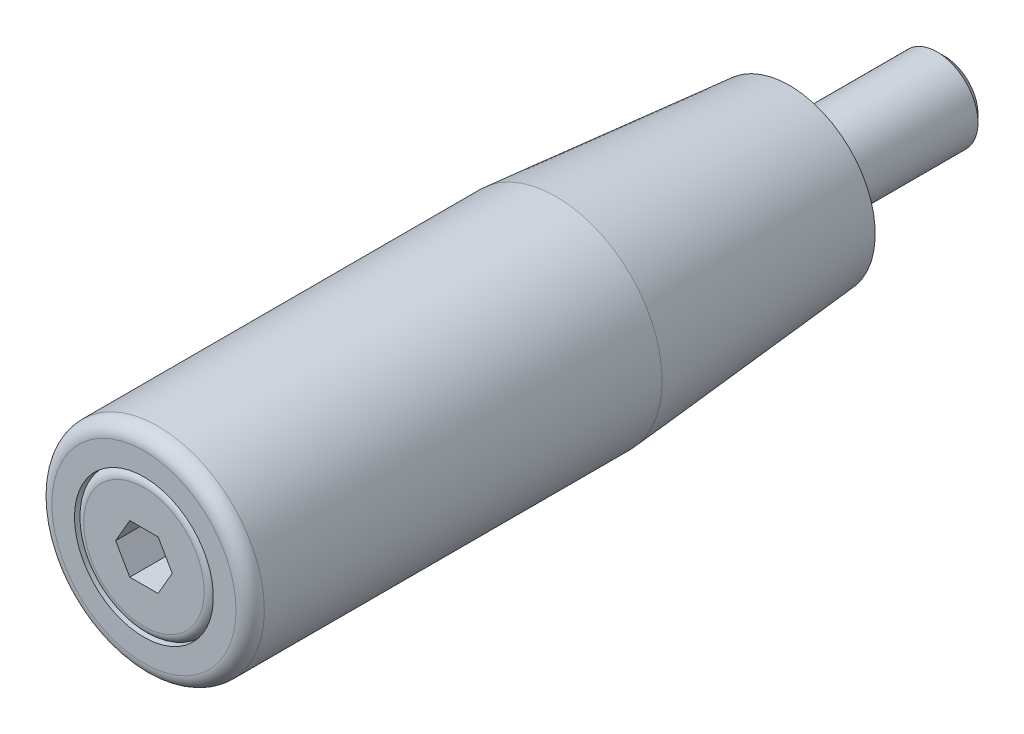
ISO-10303-21;
HEADER;
FILE_DESCRIPTION(('STEP AP214'),'2;1');
FILE_NAME('part.step','',(''),(''),'','','');
FILE_SCHEMA(('AUTOMOTIVE_DESIGN { 1 0 10303 214 1 1 1 1 }'));
ENDSEC;
DATA;
#1=APPLICATION_CONTEXT('core data for automotive mechanical design processes');
#2=APPLICATION_PROTOCOL_DEFINITION('international standard','automotive_design',2000,#1);
#3=PRODUCT_CONTEXT('',#1,'mechanical');
#4=PRODUCT('Part','Part','',(#3));
#5=PRODUCT_RELATED_PRODUCT_CATEGORY('part','',(#4));
#6=PRODUCT_DEFINITION_FORMATION('','',#4);
#7=PRODUCT_DEFINITION_CONTEXT('part definition',#1,'design');
#8=PRODUCT_DEFINITION('design','',#6,#7);
#9=PRODUCT_DEFINITION_SHAPE('','',#8);
#10=(LENGTH_UNIT() NAMED_UNIT(*) SI_UNIT(.MILLI.,.METRE.));
#11=(NAMED_UNIT(*) PLANE_ANGLE_UNIT() SI_UNIT($,.RADIAN.));
#12=(NAMED_UNIT(*) SI_UNIT($,.STERADIAN.) SOLID_ANGLE_UNIT());
#13=UNCERTAINTY_MEASURE_WITH_UNIT(LENGTH_MEASURE(1.E-05),#10,'distance_accuracy_value','');
#14=(GEOMETRIC_REPRESENTATION_CONTEXT(3) GLOBAL_UNCERTAINTY_ASSIGNED_CONTEXT((#13)) GLOBAL_UNIT_ASSIGNED_CONTEXT((#10,
#11,#12)) REPRESENTATION_CONTEXT('',''));
#15=CARTESIAN_POINT('',(0.,0.,0.));
#16=DIRECTION('',(0.,0.,1.));
#17=DIRECTION('',(1.,0.,0.));
#18=AXIS2_PLACEMENT_3D('',#15,#16,#17);
#19=CARTESIAN_POINT('',(0.,-4.,0.));
#20=DIRECTION('',(0.,0.,1.));
#21=DIRECTION('',(-1.,0.,0.));
#22=AXIS2_PLACEMENT_3D('',#19,#20,#21);
#23=PLANE('',#22);
#24=CARTESIAN_POINT('',(0.,0.,0.));
#25=DIRECTION('',(0.,0.,1.));
#26=DIRECTION('',(-1.,0.,0.));
#27=AXIS2_PLACEMENT_3D('',#24,#25,#26);
#28=CIRCLE('',#27,6.5);
#29=CARTESIAN_POINT('',(-6.5,0.,0.));
#30=VERTEX_POINT('',#29);
#31=EDGE_CURVE('E121',#30,#30,#28,.T.);
#32=ORIENTED_EDGE('',*,*,#31,.F.);
#33=EDGE_LOOP('',(#32));
#34=FACE_BOUND('',#33,.T.);
#35=CARTESIAN_POINT('',(0.,0.,0.));
#36=DIRECTION('',(0.,0.,1.));
#37=DIRECTION('',(-1.,0.,0.));
#38=AXIS2_PLACEMENT_3D('',#35,#36,#37);
#39=CIRCLE('',#38,4.);
#40=CARTESIAN_POINT('',(-4.,0.,0.));
#41=VERTEX_POINT('',#40);
#42=EDGE_CURVE('E124',#41,#41,#39,.T.);
#43=ORIENTED_EDGE('',*,*,#42,.T.);
#44=EDGE_LOOP('',(#43));
#45=FACE_BOUND('',#44,.T.);
#46=ADVANCED_FACE('F15',(#34,#45),#23,.F.);
#47=CARTESIAN_POINT('',(0.,-5.58637014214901E-13,80.));
#48=DIRECTION('',(0.,0.,1.));
#49=DIRECTION('',(-1.,0.,0.));
#50=AXIS2_PLACEMENT_3D('',#47,#48,#49);
#51=CYLINDRICAL_SURFACE('',#50,4.);
#52=ORIENTED_EDGE('',*,*,#42,.F.);
#53=EDGE_LOOP('',(#52));
#54=FACE_BOUND('',#53,.T.);
#55=CARTESIAN_POINT('',(0.,0.,-1.5));
#56=DIRECTION('',(0.,0.,1.));
#57=DIRECTION('',(-1.,0.,0.));
#58=AXIS2_PLACEMENT_3D('',#55,#56,#57);
#59=CIRCLE('',#58,4.);
#60=CARTESIAN_POINT('',(-4.,0.,-1.5));
#61=VERTEX_POINT('',#60);
#62=EDGE_CURVE('E127',#61,#61,#59,.T.);
#63=ORIENTED_EDGE('',*,*,#62,.T.);
#64=EDGE_LOOP('',(#63));
#65=FACE_BOUND('',#64,.T.);
#66=ADVANCED_FACE('F246',(#54,#65),#51,.T.);
#67=CARTESIAN_POINT('',(0.,-4.08,-1.50000000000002));
#68=DIRECTION('',(0.,0.,-1.));
#69=DIRECTION('',(1.,0.,0.));
#70=AXIS2_PLACEMENT_3D('',#67,#68,#69);
#71=PLANE('',#70);
#72=ORIENTED_EDGE('',*,*,#62,.F.);
#73=EDGE_LOOP('',(#72));
#74=FACE_BOUND('',#73,.T.);
#75=CARTESIAN_POINT('',(0.,0.,-1.5));
#76=DIRECTION('',(0.,0.,1.));
#77=DIRECTION('',(-1.,0.,0.));
#78=AXIS2_PLACEMENT_3D('',#75,#76,#77);
#79=CIRCLE('',#78,4.08);
#80=CARTESIAN_POINT('',(-4.08,0.,-1.5));
#81=VERTEX_POINT('',#80);
#82=EDGE_CURVE('E130',#81,#81,#79,.T.);
#83=ORIENTED_EDGE('',*,*,#82,.T.);
#84=EDGE_LOOP('',(#83));
#85=FACE_BOUND('',#84,.T.);
#86=ADVANCED_FACE('F242',(#74,#85),#71,.F.);
#87=CARTESIAN_POINT('',(0.,0.,-2.42));
#88=DIRECTION('',(0.,0.,-1.));
#89=DIRECTION('',(1.,0.,0.));
#90=AXIS2_PLACEMENT_3D('',#87,#88,#89);
#91=CONICAL_SURFACE('',#90,5.,0.785398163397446);
#92=ORIENTED_EDGE('',*,*,#82,.F.);
#93=EDGE_LOOP('',(#92));
#94=FACE_BOUND('',#93,.T.);
#95=CARTESIAN_POINT('',(0.,0.,-2.42));
#96=DIRECTION('',(0.,0.,1.));
#97=DIRECTION('',(-1.,0.,0.));
#98=AXIS2_PLACEMENT_3D('',#95,#96,#97);
#99=CIRCLE('',#98,5.);
#100=CARTESIAN_POINT('',(-5.,0.,-2.42));
#101=VERTEX_POINT('',#100);
#102=EDGE_CURVE('E133',#101,#101,#99,.T.);
#103=ORIENTED_EDGE('',*,*,#102,.T.);
#104=EDGE_LOOP('',(#103));
#105=FACE_BOUND('',#104,.T.);
#106=ADVANCED_FACE('F238',(#94,#105),#91,.T.);
#107=CARTESIAN_POINT('',(0.,-5.58637014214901E-13,80.));
#108=DIRECTION('',(0.,0.,1.));
#109=DIRECTION('',(-1.,0.,0.));
#110=AXIS2_PLACEMENT_3D('',#107,#108,#109);
#111=CYLINDRICAL_SURFACE('',#110,5.);
#112=ORIENTED_EDGE('',*,*,#102,.F.);
#113=EDGE_LOOP('',(#112));
#114=FACE_BOUND('',#113,.T.);
#115=CARTESIAN_POINT('',(0.,1.19269002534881E-13,-17.08));
#116=DIRECTION('',(0.,0.,1.));
#117=DIRECTION('',(-1.,0.,0.));
#118=AXIS2_PLACEMENT_3D('',#115,#116,#117);
#119=CIRCLE('',#118,5.);
#120=CARTESIAN_POINT('',(-5.,1.19269002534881E-13,-17.08));
#121=VERTEX_POINT('',#120);
#122=EDGE_CURVE('E136',#121,#121,#119,.T.);
#123=ORIENTED_EDGE('',*,*,#122,.T.);
#124=EDGE_LOOP('',(#123));
#125=FACE_BOUND('',#124,.T.);
#126=ADVANCED_FACE('F234',(#114,#125),#111,.T.);
#127=CARTESIAN_POINT('',(0.,1.25693328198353E-13,-18.));
#128=DIRECTION('',(0.,0.,1.));
#129=DIRECTION('',(-1.,0.,0.));
#130=AXIS2_PLACEMENT_3D('',#127,#128,#129);
#131=CONICAL_SURFACE('',#130,4.08,0.785398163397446);
#132=ORIENTED_EDGE('',*,*,#122,.F.);
#133=EDGE_LOOP('',(#132));
#134=FACE_BOUND('',#133,.T.);
#135=CARTESIAN_POINT('',(0.,1.25693328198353E-13,-18.));
#136=DIRECTION('',(0.,0.,1.));
#137=DIRECTION('',(-1.,0.,0.));
#138=AXIS2_PLACEMENT_3D('',#135,#136,#137);
#139=CIRCLE('',#138,4.08);
#140=CARTESIAN_POINT('',(-4.08,1.25693328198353E-13,-18.));
#141=VERTEX_POINT('',#140);
#142=EDGE_CURVE('E139',#141,#141,#139,.T.);
#143=ORIENTED_EDGE('',*,*,#142,.T.);
#144=EDGE_LOOP('',(#143));
#145=FACE_BOUND('',#144,.T.);
#146=ADVANCED_FACE('F230',(#134,#145),#131,.T.);
#147=CARTESIAN_POINT('',(0.,1.25693328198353E-13,-18.));
#148=DIRECTION('',(0.,0.,1.));
#149=DIRECTION('',(-1.,0.,0.));
#150=AXIS2_PLACEMENT_3D('',#147,#148,#149);
#151=PLANE('',#150);
#152=ORIENTED_EDGE('',*,*,#142,.F.);
#153=EDGE_LOOP('',(#152));
#154=FACE_BOUND('',#153,.T.);
#155=ADVANCED_FACE('F202',(#154),#151,.F.);
#156=CARTESIAN_POINT('',(0.,-5.58637014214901E-13,80.));
#157=DIRECTION('',(0.,0.,1.));
#158=DIRECTION('',(-1.,0.,0.));
#159=AXIS2_PLACEMENT_3D('',#156,#157,#158);
#160=CYLINDRICAL_SURFACE('',#159,6.5);
#161=CARTESIAN_POINT('',(0.,0.,1.));
#162=DIRECTION('',(0.,0.,-1.));
#163=DIRECTION('',(1.,0.,0.));
#164=AXIS2_PLACEMENT_3D('',#161,#162,#163);
#165=CIRCLE('',#164,6.5);
#166=CARTESIAN_POINT('',(6.5,0.,1.));
#167=VERTEX_POINT('',#166);
#168=EDGE_CURVE('E9',#167,#167,#165,.T.);
#169=ORIENTED_EDGE('',*,*,#168,.T.);
#170=EDGE_LOOP('',(#169));
#171=FACE_BOUND('',#170,.T.);
#172=ORIENTED_EDGE('',*,*,#31,.T.);
#173=EDGE_LOOP('',(#172));
#174=FACE_BOUND('',#173,.T.);
#175=ADVANCED_FACE('F194',(#171,#174),#160,.T.);
#176=CARTESIAN_POINT('',(0.,-5.58637014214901E-13,80.));
#177=DIRECTION('',(0.,0.,1.));
#178=DIRECTION('',(-1.,0.,0.));
#179=AXIS2_PLACEMENT_3D('',#176,#177,#178);
#180=CYLINDRICAL_SURFACE('',#179,8.5);
#181=CARTESIAN_POINT('',(0.,-5.58637014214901E-13,80.));
#182=DIRECTION('',(0.,0.,1.));
#183=DIRECTION('',(-1.,0.,0.));
#184=AXIS2_PLACEMENT_3D('',#181,#182,#183);
#185=CIRCLE('',#184,8.5);
#186=CARTESIAN_POINT('',(-8.5,-5.58637014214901E-13,80.));
#187=VERTEX_POINT('',#186);
#188=EDGE_CURVE('E167',#187,#187,#185,.T.);
#189=ORIENTED_EDGE('',*,*,#188,.T.);
#190=EDGE_LOOP('',(#189));
#191=FACE_BOUND('',#190,.T.);
#192=CARTESIAN_POINT('',(0.,-5.50722989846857E-13,78.8666666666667));
#193=DIRECTION('',(0.,0.,1.));
#194=DIRECTION('',(-1.,0.,0.));
#195=AXIS2_PLACEMENT_3D('',#192,#193,#194);
#196=CIRCLE('',#195,8.5);
#197=CARTESIAN_POINT('',(-8.5,-5.50722989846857E-13,78.8666666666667));
#198=VERTEX_POINT('',#197);
#199=EDGE_CURVE('E112',#198,#198,#196,.T.);
#200=ORIENTED_EDGE('',*,*,#199,.F.);
#201=EDGE_LOOP('',(#200));
#202=FACE_BOUND('',#201,.T.);
#203=ADVANCED_FACE('F180',(#191,#202),#180,.F.);
#204=CARTESIAN_POINT('',(0.,-8.50000000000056,80.));
#205=DIRECTION('',(0.,0.,1.));
#206=DIRECTION('',(-1.,0.,0.));
#207=AXIS2_PLACEMENT_3D('',#204,#205,#206);
#208=PLANE('',#207);
#209=CARTESIAN_POINT('',(0.,-5.58637014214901E-13,80.));
#210=DIRECTION('',(0.,0.,1.));
#211=DIRECTION('',(-1.,0.,0.));
#212=AXIS2_PLACEMENT_3D('',#209,#210,#211);
#213=CIRCLE('',#212,11.2666666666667);
#214=CARTESIAN_POINT('',(-11.2666666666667,-5.58637014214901E-13,80.));
#215=VERTEX_POINT('',#214);
#216=EDGE_CURVE('E165',#215,#215,#213,.T.);
#217=ORIENTED_EDGE('',*,*,#216,.T.);
#218=EDGE_LOOP('',(#217));
#219=FACE_BOUND('',#218,.T.);
#220=ORIENTED_EDGE('',*,*,#188,.F.);
#221=EDGE_LOOP('',(#220));
#222=FACE_BOUND('',#221,.T.);
#223=ADVANCED_FACE('F211',(#219,#222),#208,.T.);
#224=CARTESIAN_POINT('',(0.,-5.46533212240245E-13,78.2666666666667));
#225=DIRECTION('',(0.,0.,1.));
#226=DIRECTION('',(-1.,0.,0.));
#227=AXIS2_PLACEMENT_3D('',#224,#225,#226);
#228=TOROIDAL_SURFACE('',#227,11.2666666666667,1.73333333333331);
#229=CARTESIAN_POINT('',(0.,-5.46533212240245E-13,78.2666666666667));
#230=DIRECTION('',(0.,0.,1.));
#231=DIRECTION('',(-1.,0.,0.));
#232=AXIS2_PLACEMENT_3D('',#229,#230,#231);
#233=CIRCLE('',#232,13.);
#234=CARTESIAN_POINT('',(-13.,-5.46533212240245E-13,78.2666666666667));
#235=VERTEX_POINT('',#234);
#236=EDGE_CURVE('E162',#235,#235,#233,.T.);
#237=ORIENTED_EDGE('',*,*,#236,.T.);
#238=EDGE_LOOP('',(#237));
#239=FACE_BOUND('',#238,.T.);
#240=ORIENTED_EDGE('',*,*,#216,.F.);
#241=EDGE_LOOP('',(#240));
#242=FACE_BOUND('',#241,.T.);
#243=ADVANCED_FACE('F214',(#239,#242),#228,.T.);
#244=CARTESIAN_POINT('',(0.,-10.5,0.999999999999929));
#245=DIRECTION('',(0.,0.,-1.));
#246=DIRECTION('',(1.,0.,0.));
#247=AXIS2_PLACEMENT_3D('',#244,#245,#246);
#248=PLANE('',#247);
#249=ORIENTED_EDGE('',*,*,#168,.F.);
#250=EDGE_LOOP('',(#249));
#251=FACE_BOUND('',#250,.T.);
#252=CARTESIAN_POINT('',(0.,0.,1.));
#253=DIRECTION('',(0.,0.,1.));
#254=DIRECTION('',(-1.,0.,0.));
#255=AXIS2_PLACEMENT_3D('',#252,#253,#254);
#256=CIRCLE('',#255,10.5);
#257=CARTESIAN_POINT('',(-10.5,0.,1.));
#258=VERTEX_POINT('',#257);
#259=EDGE_CURVE('E156',#258,#258,#256,.T.);
#260=ORIENTED_EDGE('',*,*,#259,.F.);
#261=EDGE_LOOP('',(#260));
#262=FACE_BOUND('',#261,.T.);
#263=ADVANCED_FACE('F17',(#251,#262),#248,.T.);
#264=CARTESIAN_POINT('',(0.,-2.06522034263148E-13,29.5751307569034));
#265=DIRECTION('',(0.,0.,1.));
#266=DIRECTION('',(-1.,0.,0.));
#267=AXIS2_PLACEMENT_3D('',#264,#265,#266);
#268=CONICAL_SURFACE('',#267,13.,0.0872664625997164);
#269=ORIENTED_EDGE('',*,*,#259,.T.);
#270=EDGE_LOOP('',(#269));
#271=FACE_BOUND('',#270,.T.);
#272=CARTESIAN_POINT('',(0.,-2.06522034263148E-13,29.5751307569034));
#273=DIRECTION('',(0.,0.,1.));
#274=DIRECTION('',(-1.,0.,0.));
#275=AXIS2_PLACEMENT_3D('',#272,#273,#274);
#276=CIRCLE('',#275,13.);
#277=CARTESIAN_POINT('',(-13.,-2.06522034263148E-13,29.5751307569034));
#278=VERTEX_POINT('',#277);
#279=EDGE_CURVE('E159',#278,#278,#276,.T.);
#280=ORIENTED_EDGE('',*,*,#279,.F.);
#281=EDGE_LOOP('',(#280));
#282=FACE_BOUND('',#281,.T.);
#283=ADVANCED_FACE('F223',(#271,#282),#268,.T.);
#284=CARTESIAN_POINT('',(0.,-5.58637014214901E-13,80.));
#285=DIRECTION('',(0.,0.,1.));
#286=DIRECTION('',(-1.,0.,0.));
#287=AXIS2_PLACEMENT_3D('',#284,#285,#286);
#288=CYLINDRICAL_SURFACE('',#287,13.);
#289=ORIENTED_EDGE('',*,*,#279,.T.);
#290=EDGE_LOOP('',(#289));
#291=FACE_BOUND('',#290,.T.);
#292=ORIENTED_EDGE('',*,*,#236,.F.);
#293=EDGE_LOOP('',(#292));
#294=FACE_BOUND('',#293,.T.);
#295=ADVANCED_FACE('F219',(#291,#294),#288,.T.);
#296=CARTESIAN_POINT('',(0.,-5.50722989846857E-13,78.8666666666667));
#297=DIRECTION('',(0.,0.,1.));
#298=DIRECTION('',(-1.,0.,0.));
#299=AXIS2_PLACEMENT_3D('',#296,#297,#298);
#300=TOROIDAL_SURFACE('',#299,7.36666666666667,1.13333333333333);
#301=ORIENTED_EDGE('',*,*,#199,.T.);
#302=EDGE_LOOP('',(#301));
#303=FACE_BOUND('',#302,.T.);
#304=CARTESIAN_POINT('',(0.,-5.58637014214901E-13,80.));
#305=DIRECTION('',(0.,0.,1.));
#306=DIRECTION('',(-1.,0.,0.));
#307=AXIS2_PLACEMENT_3D('',#304,#305,#306);
#308=CIRCLE('',#307,7.36666666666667);
#309=CARTESIAN_POINT('',(-7.36666666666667,-5.58637014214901E-13,80.));
#310=VERTEX_POINT('',#309);
#311=EDGE_CURVE('E85',#310,#310,#308,.T.);
#312=ORIENTED_EDGE('',*,*,#311,.F.);
#313=EDGE_LOOP('',(#312));
#314=FACE_BOUND('',#313,.T.);
#315=ADVANCED_FACE('F222',(#303,#314),#300,.T.);
#316=CARTESIAN_POINT('',(0.,-7.36666666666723,80.));
#317=DIRECTION('',(0.,0.,-1.));
#318=DIRECTION('',(1.,0.,0.));
#319=AXIS2_PLACEMENT_3D('',#316,#317,#318);
#320=PLANE('',#319);
#321=DIRECTION('',(1.,0.,0.));
#322=VECTOR('',#321,1.);
#323=CARTESIAN_POINT('',(0.,-3.00000000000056,80.));
#324=LINE('',#323,#322);
#325=CARTESIAN_POINT('',(-1.73205080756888,-3.00000000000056,80.));
#326=VERTEX_POINT('',#325);
#327=CARTESIAN_POINT('',(1.73205080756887,-3.00000000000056,80.));
#328=VERTEX_POINT('',#327);
#329=EDGE_CURVE('E146',#326,#328,#324,.T.);
#330=ORIENTED_EDGE('',*,*,#329,.F.);
#331=DIRECTION('',(0.5,-0.866025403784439,0.));
#332=VECTOR('',#331,1.);
#333=CARTESIAN_POINT('',(0.591784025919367,-7.02500000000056,80.));
#334=LINE('',#333,#332);
#335=CARTESIAN_POINT('',(-3.46410161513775,-5.58637014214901E-13,80.));
#336=VERTEX_POINT('',#335);
#337=EDGE_CURVE('E148',#336,#326,#334,.T.);
#338=ORIENTED_EDGE('',*,*,#337,.F.);
#339=DIRECTION('',(-0.5,-0.866025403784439,0.));
#340=VECTOR('',#339,1.);
#341=CARTESIAN_POINT('',(-5.787936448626,-4.02500000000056,80.));
#342=LINE('',#341,#340);
#343=CARTESIAN_POINT('',(-1.73205080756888,2.99999999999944,80.));
#344=VERTEX_POINT('',#343);
#345=EDGE_CURVE('E151',#344,#336,#342,.T.);
#346=ORIENTED_EDGE('',*,*,#345,.F.);
#347=DIRECTION('',(-1.,0.,0.));
#348=VECTOR('',#347,1.);
#349=CARTESIAN_POINT('',(0.,2.99999999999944,80.));
#350=LINE('',#349,#348);
#351=CARTESIAN_POINT('',(1.73205080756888,2.99999999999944,80.));
#352=VERTEX_POINT('',#351);
#353=EDGE_CURVE('E41',#352,#344,#350,.T.);
#354=ORIENTED_EDGE('',*,*,#353,.F.);
#355=DIRECTION('',(-0.5,0.866025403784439,0.));
#356=VECTOR('',#355,1.);
#357=CARTESIAN_POINT('',(5.787936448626,-4.02500000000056,80.));
#358=LINE('',#357,#356);
#359=CARTESIAN_POINT('',(3.46410161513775,-5.57769652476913E-13,80.));
#360=VERTEX_POINT('',#359);
#361=EDGE_CURVE('E142',#360,#352,#358,.T.);
#362=ORIENTED_EDGE('',*,*,#361,.F.);
#363=DIRECTION('',(0.5,0.866025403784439,0.));
#364=VECTOR('',#363,1.);
#365=CARTESIAN_POINT('',(-0.591784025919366,-7.02500000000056,80.));
#366=LINE('',#365,#364);
#367=EDGE_CURVE('E144',#328,#360,#366,.T.);
#368=ORIENTED_EDGE('',*,*,#367,.F.);
#369=EDGE_LOOP('',(#330,#338,#346,#354,#362,#368));
#370=FACE_BOUND('',#369,.T.);
#371=ORIENTED_EDGE('',*,*,#311,.T.);
#372=EDGE_LOOP('',(#371));
#373=FACE_BOUND('',#372,.T.);
#374=ADVANCED_FACE('F273',(#370,#373),#320,.F.);
#375=CARTESIAN_POINT('',(-1.73205080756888,-3.0000000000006,85.));
#376=DIRECTION('',(0.,1.,0.));
#377=DIRECTION('',(-1.,0.,0.));
#378=AXIS2_PLACEMENT_3D('',#375,#376,#377);
#379=PLANE('',#378);
#380=DIRECTION('',(0.,0.,-1.));
#381=VECTOR('',#380,1.);
#382=CARTESIAN_POINT('',(-1.73205080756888,-3.0000000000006,85.));
#383=LINE('',#382,#381);
#384=CARTESIAN_POINT('',(-1.73205080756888,-3.00000000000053,75.));
#385=VERTEX_POINT('',#384);
#386=EDGE_CURVE('E106',#326,#385,#383,.T.);
#387=ORIENTED_EDGE('',*,*,#386,.F.);
#388=ORIENTED_EDGE('',*,*,#329,.T.);
#389=DIRECTION('',(0.,0.,-1.));
#390=VECTOR('',#389,1.);
#391=CARTESIAN_POINT('',(1.73205080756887,-3.0000000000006,85.));
#392=LINE('',#391,#390);
#393=CARTESIAN_POINT('',(1.73205080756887,-3.00000000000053,75.));
#394=VERTEX_POINT('',#393);
#395=EDGE_CURVE('E103',#328,#394,#392,.T.);
#396=ORIENTED_EDGE('',*,*,#395,.T.);
#397=DIRECTION('',(1.,0.,0.));
#398=VECTOR('',#397,1.);
#399=CARTESIAN_POINT('',(-1.73205080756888,-3.00000000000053,75.));
#400=LINE('',#399,#398);
#401=EDGE_CURVE('E93',#385,#394,#400,.T.);
#402=ORIENTED_EDGE('',*,*,#401,.F.);
#403=EDGE_LOOP('',(#387,#388,#396,#402));
#404=FACE_BOUND('',#403,.T.);
#405=ADVANCED_FACE('F269',(#404),#379,.T.);
#406=CARTESIAN_POINT('',(-3.46410161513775,-5.93551827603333E-13,85.));
#407=DIRECTION('',(0.866025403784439,0.5,0.));
#408=DIRECTION('',(-0.5,0.866025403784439,0.));
#409=AXIS2_PLACEMENT_3D('',#406,#407,#408);
#410=PLANE('',#409);
#411=ORIENTED_EDGE('',*,*,#337,.T.);
#412=ORIENTED_EDGE('',*,*,#386,.T.);
#413=DIRECTION('',(0.5,-0.866025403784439,0.));
#414=VECTOR('',#413,1.);
#415=CARTESIAN_POINT('',(-3.46410161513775,-5.2372220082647E-13,75.));
#416=LINE('',#415,#414);
#417=CARTESIAN_POINT('',(-3.46410161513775,-5.2372220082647E-13,75.));
#418=VERTEX_POINT('',#417);
#419=EDGE_CURVE('E91',#418,#385,#416,.T.);
#420=ORIENTED_EDGE('',*,*,#419,.F.);
#421=DIRECTION('',(0.,0.,-1.));
#422=VECTOR('',#421,1.);
#423=CARTESIAN_POINT('',(-3.46410161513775,-5.93551827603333E-13,85.));
#424=LINE('',#423,#422);
#425=EDGE_CURVE('E86',#336,#418,#424,.T.);
#426=ORIENTED_EDGE('',*,*,#425,.F.);
#427=EDGE_LOOP('',(#411,#412,#420,#426));
#428=FACE_BOUND('',#427,.T.);
#429=ADVANCED_FACE('F272',(#428),#410,.T.);
#430=CARTESIAN_POINT('',(-1.73205080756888,2.9999999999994,85.));
#431=DIRECTION('',(0.866025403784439,-0.5,0.));
#432=DIRECTION('',(0.5,0.866025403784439,0.));
#433=AXIS2_PLACEMENT_3D('',#430,#431,#432);
#434=PLANE('',#433);
#435=ORIENTED_EDGE('',*,*,#345,.T.);
#436=ORIENTED_EDGE('',*,*,#425,.T.);
#437=DIRECTION('',(-0.5,-0.866025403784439,0.));
#438=VECTOR('',#437,1.);
#439=CARTESIAN_POINT('',(-1.73205080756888,2.99999999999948,75.));
#440=LINE('',#439,#438);
#441=CARTESIAN_POINT('',(-1.73205080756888,2.99999999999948,75.));
#442=VERTEX_POINT('',#441);
#443=EDGE_CURVE('E76',#442,#418,#440,.T.);
#444=ORIENTED_EDGE('',*,*,#443,.F.);
#445=DIRECTION('',(0.,0.,-1.));
#446=VECTOR('',#445,1.);
#447=CARTESIAN_POINT('',(-1.73205080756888,2.9999999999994,85.));
#448=LINE('',#447,#446);
#449=EDGE_CURVE('E81',#344,#442,#448,.T.);
#450=ORIENTED_EDGE('',*,*,#449,.F.);
#451=EDGE_LOOP('',(#435,#436,#444,#450));
#452=FACE_BOUND('',#451,.T.);
#453=ADVANCED_FACE('F88',(#452),#434,.T.);
#454=CARTESIAN_POINT('',(1.73205080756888,2.9999999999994,85.));
#455=DIRECTION('',(0.,-1.,0.));
#456=DIRECTION('',(1.,0.,0.));
#457=AXIS2_PLACEMENT_3D('',#454,#455,#456);
#458=PLANE('',#457);
#459=ORIENTED_EDGE('',*,*,#353,.T.);
#460=ORIENTED_EDGE('',*,*,#449,.T.);
#461=DIRECTION('',(-1.,0.,0.));
#462=VECTOR('',#461,1.);
#463=CARTESIAN_POINT('',(1.73205080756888,2.99999999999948,75.));
#464=LINE('',#463,#462);
#465=CARTESIAN_POINT('',(1.73205080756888,2.99999999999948,75.));
#466=VERTEX_POINT('',#465);
#467=EDGE_CURVE('E73',#466,#442,#464,.T.);
#468=ORIENTED_EDGE('',*,*,#467,.F.);
#469=DIRECTION('',(0.,0.,-1.));
#470=VECTOR('',#469,1.);
#471=CARTESIAN_POINT('',(1.73205080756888,2.9999999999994,85.));
#472=LINE('',#471,#470);
#473=EDGE_CURVE('E100',#352,#466,#472,.T.);
#474=ORIENTED_EDGE('',*,*,#473,.F.);
#475=EDGE_LOOP('',(#459,#460,#468,#474));
#476=FACE_BOUND('',#475,.T.);
#477=ADVANCED_FACE('F82',(#476),#458,.T.);
#478=CARTESIAN_POINT('',(3.46410161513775,-5.93551827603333E-13,85.));
#479=DIRECTION('',(-0.866025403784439,-0.5,0.));
#480=DIRECTION('',(0.5,-0.866025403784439,0.));
#481=AXIS2_PLACEMENT_3D('',#478,#479,#480);
#482=PLANE('',#481);
#483=ORIENTED_EDGE('',*,*,#361,.T.);
#484=ORIENTED_EDGE('',*,*,#473,.T.);
#485=DIRECTION('',(-0.5,0.866025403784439,0.));
#486=VECTOR('',#485,1.);
#487=CARTESIAN_POINT('',(3.46410161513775,-5.2372220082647E-13,75.));
#488=LINE('',#487,#486);
#489=CARTESIAN_POINT('',(3.46410161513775,-5.2372220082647E-13,75.));
#490=VERTEX_POINT('',#489);
#491=EDGE_CURVE('E78',#490,#466,#488,.T.);
#492=ORIENTED_EDGE('',*,*,#491,.F.);
#493=DIRECTION('',(0.,0.,-1.));
#494=VECTOR('',#493,1.);
#495=CARTESIAN_POINT('',(3.46410161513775,-5.93551827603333E-13,85.));
#496=LINE('',#495,#494);
#497=EDGE_CURVE('E33',#360,#490,#496,.T.);
#498=ORIENTED_EDGE('',*,*,#497,.F.);
#499=EDGE_LOOP('',(#483,#484,#492,#498));
#500=FACE_BOUND('',#499,.T.);
#501=ADVANCED_FACE('F263',(#500),#482,.T.);
#502=CARTESIAN_POINT('',(1.73205080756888,-3.0000000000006,85.));
#503=DIRECTION('',(-0.866025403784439,0.5,0.));
#504=DIRECTION('',(-0.5,-0.866025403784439,0.));
#505=AXIS2_PLACEMENT_3D('',#502,#503,#504);
#506=PLANE('',#505);
#507=ORIENTED_EDGE('',*,*,#367,.T.);
#508=ORIENTED_EDGE('',*,*,#497,.T.);
#509=DIRECTION('',(0.5,0.866025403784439,0.));
#510=VECTOR('',#509,1.);
#511=CARTESIAN_POINT('',(1.73205080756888,-3.00000000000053,75.));
#512=LINE('',#511,#510);
#513=EDGE_CURVE('E97',#394,#490,#512,.T.);
#514=ORIENTED_EDGE('',*,*,#513,.F.);
#515=ORIENTED_EDGE('',*,*,#395,.F.);
#516=EDGE_LOOP('',(#507,#508,#514,#515));
#517=FACE_BOUND('',#516,.T.);
#518=ADVANCED_FACE('F257',(#517),#506,.T.);
#519=CARTESIAN_POINT('',(0.,-5.2372220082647E-13,75.));
#520=DIRECTION('',(0.,0.,1.));
#521=DIRECTION('',(-1.,0.,0.));
#522=AXIS2_PLACEMENT_3D('',#519,#520,#521);
#523=PLANE('',#522);
#524=ORIENTED_EDGE('',*,*,#419,.T.);
#525=ORIENTED_EDGE('',*,*,#401,.T.);
#526=ORIENTED_EDGE('',*,*,#513,.T.);
#527=ORIENTED_EDGE('',*,*,#491,.T.);
#528=ORIENTED_EDGE('',*,*,#467,.T.);
#529=ORIENTED_EDGE('',*,*,#443,.T.);
#530=EDGE_LOOP('',(#524,#525,#526,#527,#528,#529));
#531=FACE_BOUND('',#530,.T.);
#532=ADVANCED_FACE('F74',(#531),#523,.T.);
#533=CLOSED_SHELL('',(#46,#66,#86,#106,#126,#146,#155,#175,#203,#223,#243,#263,#283,#295,#315,
#374,#405,#429,#453,#477,#501,#518,#532));
#534=CARTESIAN_POINT('',(0.,-4.95790350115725E-13,71.));
#535=DIRECTION('',(0.,0.,1.));
#536=DIRECTION('',(-1.,0.,0.));
#537=AXIS2_PLACEMENT_3D('',#534,#535,#536);
#538=CIRCLE('',#537,6.5);
#539=CARTESIAN_POINT('',(-6.5,-4.95790350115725E-13,71.));
#540=VERTEX_POINT('',#539);
#541=EDGE_CURVE('E25',#540,#540,#538,.T.);
#542=ORIENTED_EDGE('',*,*,#541,.T.);
#543=EDGE_LOOP('',(#542));
#544=FACE_BOUND('',#543,.T.);
#545=CARTESIAN_POINT('',(0.,-5.04868201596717E-13,72.3));
#546=DIRECTION('',(0.,0.,1.));
#547=DIRECTION('',(-1.,0.,0.));
#548=AXIS2_PLACEMENT_3D('',#545,#546,#547);
#549=CIRCLE('',#548,6.5);
#550=CARTESIAN_POINT('',(-6.5,-5.04868201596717E-13,72.3));
#551=VERTEX_POINT('',#550);
#552=EDGE_CURVE('E118',#551,#551,#549,.T.);
#553=ORIENTED_EDGE('',*,*,#552,.F.);
#554=EDGE_LOOP('',(#553));
#555=FACE_BOUND('',#554,.T.);
#556=ADVANCED_FACE('F181',(#544,#555),#160,.T.);
#557=CARTESIAN_POINT('',(0.,-6.50000000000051,72.3));
#558=DIRECTION('',(0.,0.,1.));
#559=DIRECTION('',(-1.,0.,0.));
#560=AXIS2_PLACEMENT_3D('',#557,#558,#559);
#561=PLANE('',#560);
#562=CARTESIAN_POINT('',(0.,-5.04868201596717E-13,72.3));
#563=DIRECTION('',(0.,0.,1.));
#564=DIRECTION('',(-1.,0.,0.));
#565=AXIS2_PLACEMENT_3D('',#562,#563,#564);
#566=CIRCLE('',#565,8.5);
#567=CARTESIAN_POINT('',(-8.5,-5.04868201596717E-13,72.3));
#568=VERTEX_POINT('',#567);
#569=EDGE_CURVE('E115',#568,#568,#566,.T.);
#570=ORIENTED_EDGE('',*,*,#569,.F.);
#571=EDGE_LOOP('',(#570));
#572=FACE_BOUND('',#571,.T.);
#573=ORIENTED_EDGE('',*,*,#552,.T.);
#574=EDGE_LOOP('',(#573));
#575=FACE_BOUND('',#574,.T.);
#576=ADVANCED_FACE('F185',(#572,#575),#561,.F.);
#577=CARTESIAN_POINT('',(0.,-6.5000000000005,71.));
#578=DIRECTION('',(0.,0.,1.));
#579=DIRECTION('',(-1.,0.,0.));
#580=AXIS2_PLACEMENT_3D('',#577,#578,#579);
#581=PLANE('',#580);
#582=ORIENTED_EDGE('',*,*,#541,.F.);
#583=EDGE_LOOP('',(#582));
#584=FACE_BOUND('',#583,.T.);
#585=CARTESIAN_POINT('',(0.,-4.95790350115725E-13,71.));
#586=DIRECTION('',(0.,0.,1.));
#587=DIRECTION('',(-1.,0.,0.));
#588=AXIS2_PLACEMENT_3D('',#585,#586,#587);
#589=CIRCLE('',#588,8.5);
#590=CARTESIAN_POINT('',(-8.5,-4.95790350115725E-13,71.));
#591=VERTEX_POINT('',#590);
#592=EDGE_CURVE('E19',#591,#591,#589,.T.);
#593=ORIENTED_EDGE('',*,*,#592,.T.);
#594=EDGE_LOOP('',(#593));
#595=FACE_BOUND('',#594,.T.);
#596=ADVANCED_FACE('F174',(#584,#595),#581,.T.);
#597=ORIENTED_EDGE('',*,*,#592,.F.);
#598=EDGE_LOOP('',(#597));
#599=FACE_BOUND('',#598,.T.);
#600=ORIENTED_EDGE('',*,*,#569,.T.);
#601=EDGE_LOOP('',(#600));
#602=FACE_BOUND('',#601,.T.);
#603=ADVANCED_FACE('F176',(#599,#602),#180,.F.);
#604=CLOSED_SHELL('',(#556,#576,#596,#603));
#605=ORIENTED_CLOSED_SHELL('',*,#604,.T.);
#606=BREP_WITH_VOIDS('B1',#533,(#605));
#607=ADVANCED_BREP_SHAPE_REPRESENTATION('',(#18,#606),#14);
#608=SHAPE_DEFINITION_REPRESENTATION(#9,#607);
ENDSEC;
END-ISO-10303-21;
